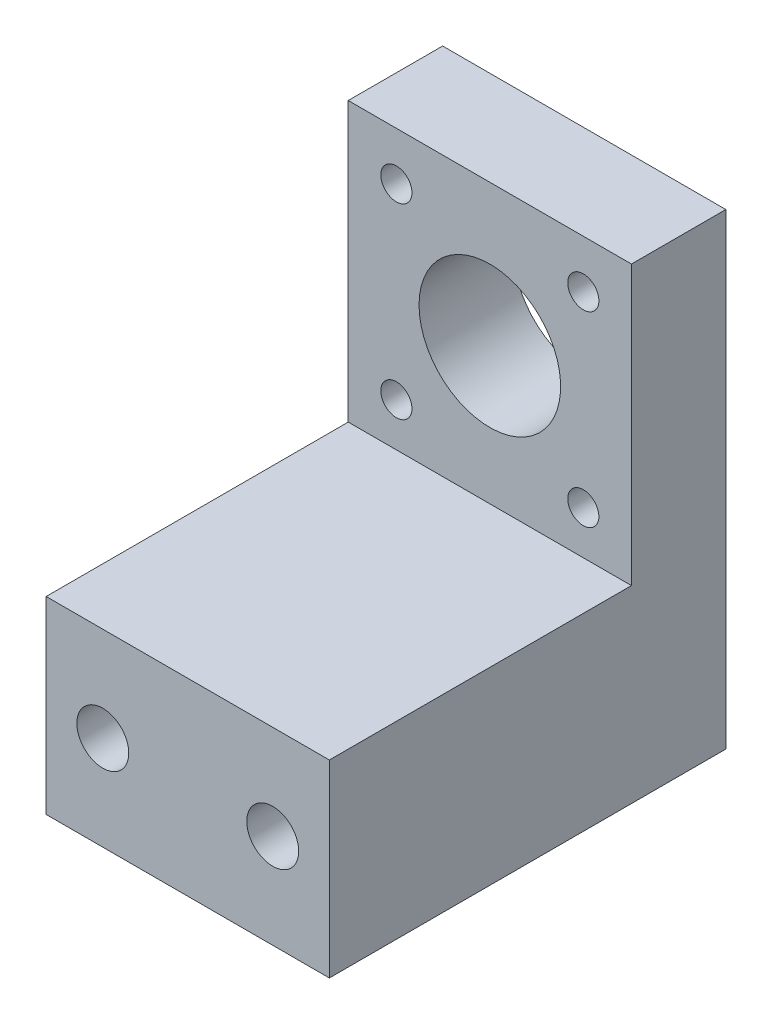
from build123d import *

# Parameters (mm, degrees)
SKETCH_1_W          = 30
SKETCH_1_H          = 49.5
SKETCH_1_R          = 7.5
SKETCH_1_R_2        = 2.75
EXTRUDE_1_DEPTH     = 42
SKETCH_2_OUTSIDE_W  = 58.302
SKETCH_2_OUTSIDE_H  = 65.802
CUT_EXTRUDE_1_DEPTH = 42
SKETCH_3_R          = 1.65
CUT_EXTRUDE_2_DEPTH = 42
SKETCH_5_R          = 4.75
CUT_EXTRUDE_3_DEPTH = 5.5


with BuildPart() as part:
    # Sketch 1 → Extrude 1 (new body)
    with BuildSketch(Plane.XY):
        with Locations((15, 24.75)):
            Rectangle(SKETCH_1_W, SKETCH_1_H)
        with Locations(Location((15, 34.5, 0), (0, 0, 180))):
            Circle(SKETCH_1_R, mode=Mode.SUBTRACT)
        with Locations(Location((24, 10, 0), (0, 0, 180))):
            Circle(SKETCH_1_R_2, mode=Mode.SUBTRACT)
        with Locations(Location((6, 10, 0), (0, 0, 180))):
            Circle(SKETCH_1_R_2, mode=Mode.SUBTRACT)
    extrude(amount=EXTRUDE_1_DEPTH)

    # Sketch 2 outside → Cut-Extrude 1 (cut)
    with BuildSketch(Plane(origin=(30, 0, 0), x_dir=(0, 0, -1), z_dir=(1, 0, 0))):
        with Locations((-21, 24.75)):
            Rectangle(SKETCH_2_OUTSIDE_W, SKETCH_2_OUTSIDE_H)
        Polygon((-42, 0), (-42, 20), (-10, 20), (-10, 49.5), (0, 49.5), (0, 0), align=None, mode=Mode.SUBTRACT)
    extrude(amount=-CUT_EXTRUDE_1_DEPTH, mode=Mode.SUBTRACT)

    # Sketch 3 → Cut-Extrude 2 (cut)
    with BuildSketch(Plane.XY.offset(10)):
        with Locations((5.1, 24.6)):
            Circle(SKETCH_3_R)
        with Locations((24.9, 44.4)):
            Circle(SKETCH_3_R)
        with Locations((24.9, 24.6)):
            Circle(SKETCH_3_R)
        with Locations((5.1, 44.4)):
            Circle(SKETCH_3_R)
    extrude(amount=-CUT_EXTRUDE_2_DEPTH, mode=Mode.SUBTRACT)

    # Sketch 5 → Cut-Extrude 3 (cut)
    with BuildSketch(Plane(origin=(0, 0, 0), x_dir=(-1, 0, 0), z_dir=(0, 0, -1))):
        with Locations((-24, 10)):
            Circle(SKETCH_5_R)
        with Locations((-6, 10)):
            Circle(SKETCH_5_R)
    extrude(amount=-CUT_EXTRUDE_3_DEPTH, mode=Mode.SUBTRACT)


solid = part.part
